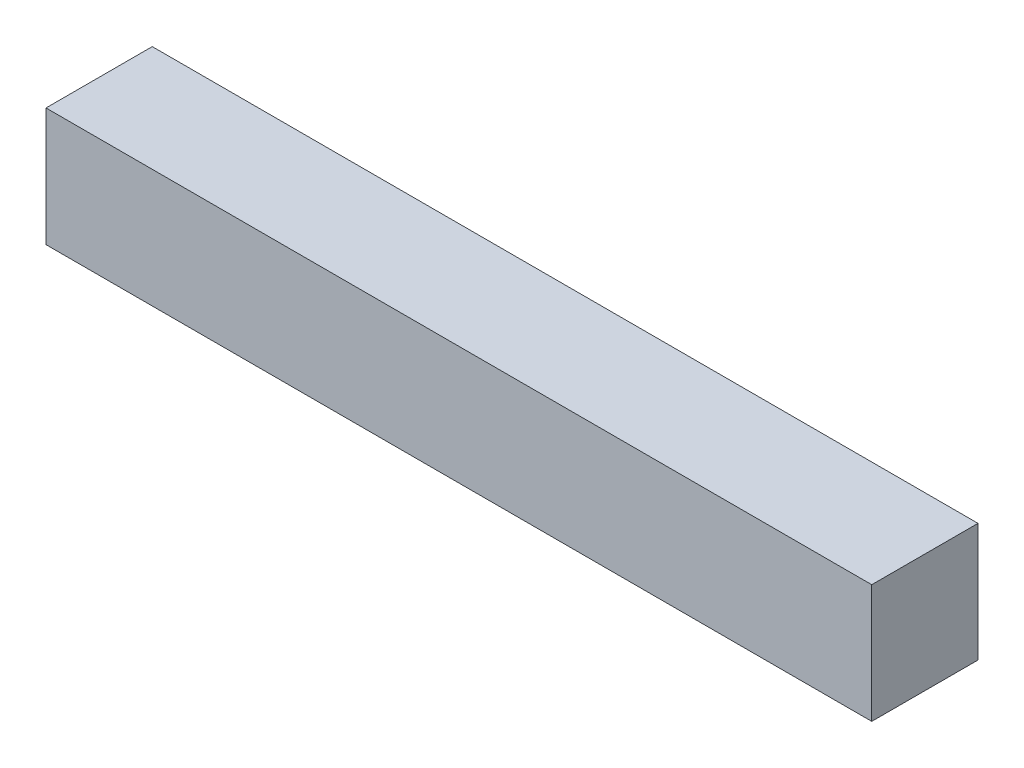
from build123d import *

# Parameters (mm, degrees)
SKETCH1_W           = 272
SKETCH1_H           = 39
BOSS_EXTRUDE2_DEPTH = 35


with BuildPart() as part:
    # Sketch1 → Boss-Extrude2 (new body)
    with BuildSketch(Plane.XY):
        with Locations((10.37751004, 15.637884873)):
            Rectangle(SKETCH1_W, SKETCH1_H)
    extrude(amount=BOSS_EXTRUDE2_DEPTH)


solid = part.part
